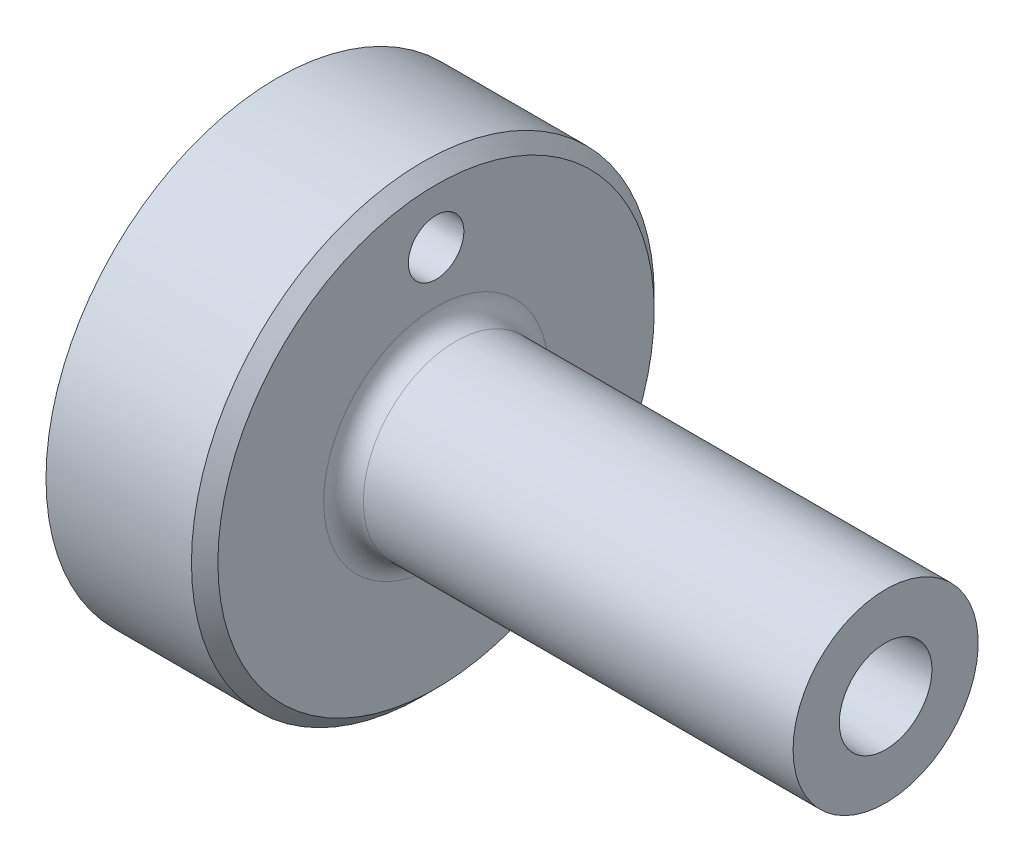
ISO-10303-21;
HEADER;
FILE_DESCRIPTION(('STEP AP214'),'2;1');
FILE_NAME('part.step','',(''),(''),'','','');
FILE_SCHEMA(('AUTOMOTIVE_DESIGN { 1 0 10303 214 1 1 1 1 }'));
ENDSEC;
DATA;
#1=APPLICATION_CONTEXT('core data for automotive mechanical design processes');
#2=APPLICATION_PROTOCOL_DEFINITION('international standard','automotive_design',2000,#1);
#3=PRODUCT_CONTEXT('',#1,'mechanical');
#4=PRODUCT('Part','Part','',(#3));
#5=PRODUCT_RELATED_PRODUCT_CATEGORY('part','',(#4));
#6=PRODUCT_DEFINITION_FORMATION('','',#4);
#7=PRODUCT_DEFINITION_CONTEXT('part definition',#1,'design');
#8=PRODUCT_DEFINITION('design','',#6,#7);
#9=PRODUCT_DEFINITION_SHAPE('','',#8);
#10=(LENGTH_UNIT() NAMED_UNIT(*) SI_UNIT(.MILLI.,.METRE.));
#11=(NAMED_UNIT(*) PLANE_ANGLE_UNIT() SI_UNIT($,.RADIAN.));
#12=(NAMED_UNIT(*) SI_UNIT($,.STERADIAN.) SOLID_ANGLE_UNIT());
#13=UNCERTAINTY_MEASURE_WITH_UNIT(LENGTH_MEASURE(1.E-05),#10,'distance_accuracy_value','');
#14=(GEOMETRIC_REPRESENTATION_CONTEXT(3) GLOBAL_UNCERTAINTY_ASSIGNED_CONTEXT((#13)) GLOBAL_UNIT_ASSIGNED_CONTEXT((#10,
#11,#12)) REPRESENTATION_CONTEXT('',''));
#15=CARTESIAN_POINT('',(0.,0.,0.));
#16=DIRECTION('',(0.,0.,1.));
#17=DIRECTION('',(1.,0.,0.));
#18=AXIS2_PLACEMENT_3D('',#15,#16,#17);
#19=CARTESIAN_POINT('',(13.5,0.,0.));
#20=DIRECTION('',(-1.,0.,0.));
#21=DIRECTION('',(0.,0.,1.));
#22=AXIS2_PLACEMENT_3D('',#19,#20,#21);
#23=TOROIDAL_SURFACE('',#22,8.5,1.5);
#24=CARTESIAN_POINT('',(12.,0.,0.));
#25=DIRECTION('',(-1.,0.,0.));
#26=DIRECTION('',(0.,0.,1.));
#27=AXIS2_PLACEMENT_3D('',#24,#25,#26);
#28=CIRCLE('',#27,8.5);
#29=CARTESIAN_POINT('',(12.,0.,8.5));
#30=VERTEX_POINT('',#29);
#31=EDGE_CURVE('E28',#30,#30,#28,.T.);
#32=ORIENTED_EDGE('',*,*,#31,.F.);
#33=EDGE_LOOP('',(#32));
#34=FACE_BOUND('',#33,.T.);
#35=CARTESIAN_POINT('',(13.5,0.,0.));
#36=DIRECTION('',(-1.,0.,0.));
#37=DIRECTION('',(0.,0.,1.));
#38=AXIS2_PLACEMENT_3D('',#35,#36,#37);
#39=CIRCLE('',#38,7.);
#40=CARTESIAN_POINT('',(13.5,0.,7.));
#41=VERTEX_POINT('',#40);
#42=EDGE_CURVE('E60',#41,#41,#39,.T.);
#43=ORIENTED_EDGE('',*,*,#42,.T.);
#44=EDGE_LOOP('',(#43));
#45=FACE_BOUND('',#44,.T.);
#46=ADVANCED_FACE('F13',(#34,#45),#23,.F.);
#47=CARTESIAN_POINT('',(12.,17.5,0.));
#48=DIRECTION('',(-1.,0.,0.));
#49=DIRECTION('',(0.,0.,1.));
#50=AXIS2_PLACEMENT_3D('',#47,#48,#49);
#51=PLANE('',#50);
#52=CARTESIAN_POINT('',(12.,0.,0.));
#53=DIRECTION('',(-1.,0.,0.));
#54=DIRECTION('',(0.,0.,1.));
#55=AXIS2_PLACEMENT_3D('',#52,#53,#54);
#56=CIRCLE('',#55,16.5);
#57=CARTESIAN_POINT('',(12.,0.,16.5));
#58=VERTEX_POINT('',#57);
#59=EDGE_CURVE('E8',#58,#58,#56,.F.);
#60=ORIENTED_EDGE('',*,*,#59,.T.);
#61=EDGE_LOOP('',(#60));
#62=FACE_BOUND('',#61,.T.);
#63=CARTESIAN_POINT('',(12.,12.4,0.));
#64=DIRECTION('',(-1.,0.,0.));
#65=DIRECTION('',(0.,0.,1.));
#66=AXIS2_PLACEMENT_3D('',#63,#64,#65);
#67=CIRCLE('',#66,2.1);
#68=CARTESIAN_POINT('',(12.,12.4,2.1));
#69=VERTEX_POINT('',#68);
#70=EDGE_CURVE('E38',#69,#69,#67,.T.);
#71=ORIENTED_EDGE('',*,*,#70,.T.);
#72=EDGE_LOOP('',(#71));
#73=FACE_BOUND('',#72,.T.);
#74=ORIENTED_EDGE('',*,*,#31,.T.);
#75=EDGE_LOOP('',(#74));
#76=FACE_BOUND('',#75,.T.);
#77=ADVANCED_FACE('F102',(#62,#73,#76),#51,.F.);
#78=CARTESIAN_POINT('',(0.,0.,0.));
#79=DIRECTION('',(-1.,0.,0.));
#80=DIRECTION('',(0.,0.,1.));
#81=AXIS2_PLACEMENT_3D('',#78,#79,#80);
#82=CYLINDRICAL_SURFACE('',#81,17.5);
#83=CARTESIAN_POINT('',(11.,0.,0.));
#84=DIRECTION('',(-1.,0.,0.));
#85=DIRECTION('',(0.,0.,1.));
#86=AXIS2_PLACEMENT_3D('',#83,#84,#85);
#87=CIRCLE('',#86,17.5);
#88=CARTESIAN_POINT('',(11.,0.,17.5));
#89=VERTEX_POINT('',#88);
#90=EDGE_CURVE('E21',#89,#89,#87,.T.);
#91=ORIENTED_EDGE('',*,*,#90,.T.);
#92=EDGE_LOOP('',(#91));
#93=FACE_BOUND('',#92,.T.);
#94=CARTESIAN_POINT('',(0.,0.,0.));
#95=DIRECTION('',(-1.,0.,0.));
#96=DIRECTION('',(0.,0.,1.));
#97=AXIS2_PLACEMENT_3D('',#94,#95,#96);
#98=CIRCLE('',#97,17.5);
#99=CARTESIAN_POINT('',(0.,0.,17.5));
#100=VERTEX_POINT('',#99);
#101=EDGE_CURVE('E35',#100,#100,#98,.T.);
#102=ORIENTED_EDGE('',*,*,#101,.F.);
#103=EDGE_LOOP('',(#102));
#104=FACE_BOUND('',#103,.T.);
#105=ADVANCED_FACE('F95',(#93,#104),#82,.T.);
#106=CARTESIAN_POINT('',(0.,4.10062261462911,0.));
#107=DIRECTION('',(1.,0.,0.));
#108=DIRECTION('',(0.,0.,-1.));
#109=AXIS2_PLACEMENT_3D('',#106,#107,#108);
#110=PLANE('',#109);
#111=CARTESIAN_POINT('',(0.,12.4,0.));
#112=DIRECTION('',(-1.,0.,0.));
#113=DIRECTION('',(0.,0.,1.));
#114=AXIS2_PLACEMENT_3D('',#111,#112,#113);
#115=CIRCLE('',#114,3.6);
#116=CARTESIAN_POINT('',(0.,12.4,3.6));
#117=VERTEX_POINT('',#116);
#118=EDGE_CURVE('E40',#117,#117,#115,.T.);
#119=ORIENTED_EDGE('',*,*,#118,.F.);
#120=EDGE_LOOP('',(#119));
#121=FACE_BOUND('',#120,.T.);
#122=CARTESIAN_POINT('',(0.,0.,0.));
#123=DIRECTION('',(-1.,0.,0.));
#124=DIRECTION('',(0.,0.,1.));
#125=AXIS2_PLACEMENT_3D('',#122,#123,#124);
#126=CIRCLE('',#125,4.10062261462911);
#127=CARTESIAN_POINT('',(0.,0.,4.10062261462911));
#128=VERTEX_POINT('',#127);
#129=EDGE_CURVE('E46',#128,#128,#126,.T.);
#130=ORIENTED_EDGE('',*,*,#129,.F.);
#131=EDGE_LOOP('',(#130));
#132=FACE_BOUND('',#131,.T.);
#133=ORIENTED_EDGE('',*,*,#101,.T.);
#134=EDGE_LOOP('',(#133));
#135=FACE_BOUND('',#134,.T.);
#136=ADVANCED_FACE('F91',(#121,#132,#135),#110,.F.);
#137=CARTESIAN_POINT('',(0.,0.,0.));
#138=DIRECTION('',(-1.,0.,0.));
#139=DIRECTION('',(0.,0.,1.));
#140=AXIS2_PLACEMENT_3D('',#137,#138,#139);
#141=CONICAL_SURFACE('',#140,4.10062261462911,0.610865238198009);
#142=CARTESIAN_POINT('',(3.,0.,0.));
#143=DIRECTION('',(-1.,0.,0.));
#144=DIRECTION('',(0.,0.,1.));
#145=AXIS2_PLACEMENT_3D('',#142,#143,#144);
#146=CIRCLE('',#145,2.);
#147=CARTESIAN_POINT('',(3.,0.,2.));
#148=VERTEX_POINT('',#147);
#149=EDGE_CURVE('E49',#148,#148,#146,.T.);
#150=ORIENTED_EDGE('',*,*,#149,.F.);
#151=EDGE_LOOP('',(#150));
#152=FACE_BOUND('',#151,.T.);
#153=ORIENTED_EDGE('',*,*,#129,.T.);
#154=EDGE_LOOP('',(#153));
#155=FACE_BOUND('',#154,.T.);
#156=ADVANCED_FACE('F94',(#152,#155),#141,.F.);
#157=CARTESIAN_POINT('',(3.,0.,0.));
#158=DIRECTION('',(1.,0.,0.));
#159=DIRECTION('',(0.,0.,-1.));
#160=AXIS2_PLACEMENT_3D('',#157,#158,#159);
#161=CONICAL_SURFACE('',#160,2.,0.0349065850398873);
#162=CARTESIAN_POINT('',(46.,0.,0.));
#163=DIRECTION('',(-1.,0.,0.));
#164=DIRECTION('',(0.,0.,1.));
#165=AXIS2_PLACEMENT_3D('',#162,#163,#164);
#166=CIRCLE('',#165,3.50159308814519);
#167=CARTESIAN_POINT('',(46.,0.,3.50159308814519));
#168=VERTEX_POINT('',#167);
#169=EDGE_CURVE('E53',#168,#168,#166,.T.);
#170=ORIENTED_EDGE('',*,*,#169,.F.);
#171=EDGE_LOOP('',(#170));
#172=FACE_BOUND('',#171,.T.);
#173=ORIENTED_EDGE('',*,*,#149,.T.);
#174=EDGE_LOOP('',(#173));
#175=FACE_BOUND('',#174,.T.);
#176=ADVANCED_FACE('F123',(#172,#175),#161,.F.);
#177=CARTESIAN_POINT('',(46.,7.,0.));
#178=DIRECTION('',(-1.,0.,0.));
#179=DIRECTION('',(0.,0.,1.));
#180=AXIS2_PLACEMENT_3D('',#177,#178,#179);
#181=PLANE('',#180);
#182=CARTESIAN_POINT('',(46.,0.,0.));
#183=DIRECTION('',(-1.,0.,0.));
#184=DIRECTION('',(0.,0.,1.));
#185=AXIS2_PLACEMENT_3D('',#182,#183,#184);
#186=CIRCLE('',#185,7.);
#187=CARTESIAN_POINT('',(46.,0.,7.));
#188=VERTEX_POINT('',#187);
#189=EDGE_CURVE('E57',#188,#188,#186,.T.);
#190=ORIENTED_EDGE('',*,*,#189,.F.);
#191=EDGE_LOOP('',(#190));
#192=FACE_BOUND('',#191,.T.);
#193=ORIENTED_EDGE('',*,*,#169,.T.);
#194=EDGE_LOOP('',(#193));
#195=FACE_BOUND('',#194,.T.);
#196=ADVANCED_FACE('F117',(#192,#195),#181,.F.);
#197=CARTESIAN_POINT('',(0.,0.,0.));
#198=DIRECTION('',(-1.,0.,0.));
#199=DIRECTION('',(0.,0.,1.));
#200=AXIS2_PLACEMENT_3D('',#197,#198,#199);
#201=CYLINDRICAL_SURFACE('',#200,7.);
#202=ORIENTED_EDGE('',*,*,#42,.F.);
#203=EDGE_LOOP('',(#202));
#204=FACE_BOUND('',#203,.T.);
#205=ORIENTED_EDGE('',*,*,#189,.T.);
#206=EDGE_LOOP('',(#205));
#207=FACE_BOUND('',#206,.T.);
#208=ADVANCED_FACE('F87',(#204,#207),#201,.T.);
#209=CARTESIAN_POINT('',(5.,12.4,0.));
#210=DIRECTION('',(-1.,0.,0.));
#211=DIRECTION('',(0.,0.,1.));
#212=AXIS2_PLACEMENT_3D('',#209,#210,#211);
#213=CYLINDRICAL_SURFACE('',#212,3.6);
#214=CARTESIAN_POINT('',(5.,12.4,0.));
#215=DIRECTION('',(-1.,0.,0.));
#216=DIRECTION('',(0.,0.,1.));
#217=AXIS2_PLACEMENT_3D('',#214,#215,#216);
#218=CIRCLE('',#217,3.6);
#219=CARTESIAN_POINT('',(5.,12.4,3.6));
#220=VERTEX_POINT('',#219);
#221=EDGE_CURVE('E64',#220,#220,#218,.T.);
#222=ORIENTED_EDGE('',*,*,#221,.F.);
#223=EDGE_LOOP('',(#222));
#224=FACE_BOUND('',#223,.T.);
#225=ORIENTED_EDGE('',*,*,#118,.T.);
#226=EDGE_LOOP('',(#225));
#227=FACE_BOUND('',#226,.T.);
#228=ADVANCED_FACE('F81',(#224,#227),#213,.F.);
#229=CARTESIAN_POINT('',(5.,12.4,0.));
#230=DIRECTION('',(-1.,0.,0.));
#231=DIRECTION('',(0.,0.,1.));
#232=AXIS2_PLACEMENT_3D('',#229,#230,#231);
#233=PLANE('',#232);
#234=CARTESIAN_POINT('',(5.,12.4,0.));
#235=DIRECTION('',(-1.,0.,0.));
#236=DIRECTION('',(0.,0.,1.));
#237=AXIS2_PLACEMENT_3D('',#234,#235,#236);
#238=CIRCLE('',#237,2.1);
#239=CARTESIAN_POINT('',(5.,12.4,2.1));
#240=VERTEX_POINT('',#239);
#241=EDGE_CURVE('E41',#240,#240,#238,.T.);
#242=ORIENTED_EDGE('',*,*,#241,.F.);
#243=EDGE_LOOP('',(#242));
#244=FACE_BOUND('',#243,.T.);
#245=ORIENTED_EDGE('',*,*,#221,.T.);
#246=EDGE_LOOP('',(#245));
#247=FACE_BOUND('',#246,.T.);
#248=ADVANCED_FACE('F78',(#244,#247),#233,.T.);
#249=CARTESIAN_POINT('',(46.,12.4,0.));
#250=DIRECTION('',(-1.,0.,0.));
#251=DIRECTION('',(0.,0.,1.));
#252=AXIS2_PLACEMENT_3D('',#249,#250,#251);
#253=CYLINDRICAL_SURFACE('',#252,2.1);
#254=ORIENTED_EDGE('',*,*,#241,.T.);
#255=EDGE_LOOP('',(#254));
#256=FACE_BOUND('',#255,.T.);
#257=ORIENTED_EDGE('',*,*,#70,.F.);
#258=EDGE_LOOP('',(#257));
#259=FACE_BOUND('',#258,.T.);
#260=ADVANCED_FACE('F75',(#256,#259),#253,.F.);
#261=CARTESIAN_POINT('',(11.,0.,0.));
#262=DIRECTION('',(-1.,0.,0.));
#263=DIRECTION('',(0.,0.,1.));
#264=AXIS2_PLACEMENT_3D('',#261,#262,#263);
#265=CONICAL_SURFACE('',#264,17.5,0.785398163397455);
#266=ORIENTED_EDGE('',*,*,#59,.F.);
#267=EDGE_LOOP('',(#266));
#268=FACE_BOUND('',#267,.T.);
#269=ORIENTED_EDGE('',*,*,#90,.F.);
#270=EDGE_LOOP('',(#269));
#271=FACE_BOUND('',#270,.T.);
#272=ADVANCED_FACE('F15',(#268,#271),#265,.T.);
#273=CLOSED_SHELL('',(#46,#77,#105,#136,#156,#176,#196,#208,#228,#248,#260,#272));
#274=MANIFOLD_SOLID_BREP('B1',#273);
#275=ADVANCED_BREP_SHAPE_REPRESENTATION('',(#18,#274),#14);
#276=SHAPE_DEFINITION_REPRESENTATION(#9,#275);
ENDSEC;
END-ISO-10303-21;
